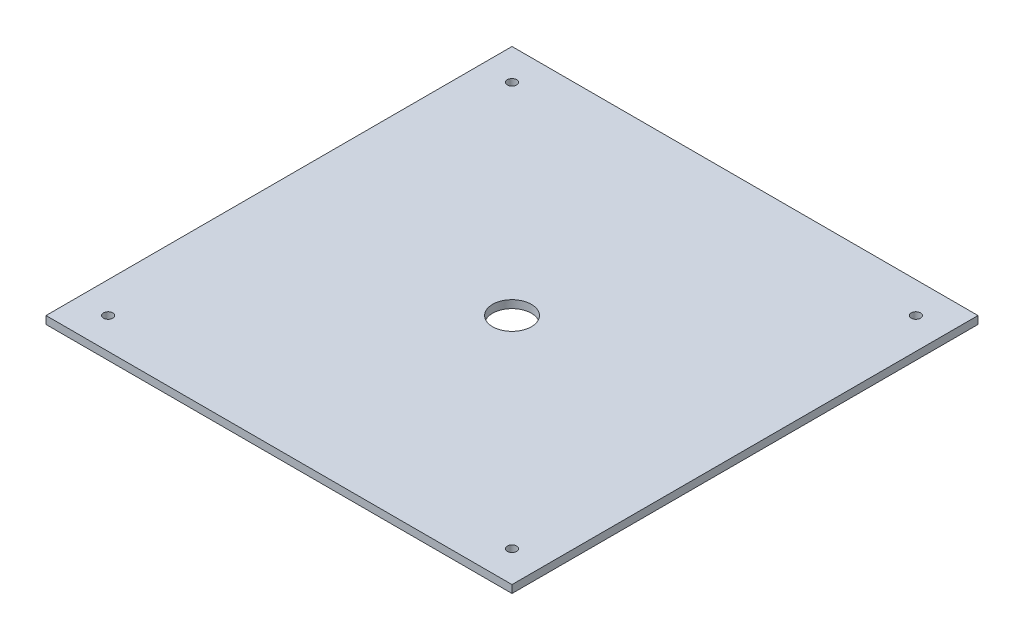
ISO-10303-21;
HEADER;
FILE_DESCRIPTION(('STEP AP214'),'2;1');
FILE_NAME('part.step','',(''),(''),'','','');
FILE_SCHEMA(('AUTOMOTIVE_DESIGN { 1 0 10303 214 1 1 1 1 }'));
ENDSEC;
DATA;
#1=APPLICATION_CONTEXT('core data for automotive mechanical design processes');
#2=APPLICATION_PROTOCOL_DEFINITION('international standard','automotive_design',2000,#1);
#3=PRODUCT_CONTEXT('',#1,'mechanical');
#4=PRODUCT('Part','Part','',(#3));
#5=PRODUCT_RELATED_PRODUCT_CATEGORY('part','',(#4));
#6=PRODUCT_DEFINITION_FORMATION('','',#4);
#7=PRODUCT_DEFINITION_CONTEXT('part definition',#1,'design');
#8=PRODUCT_DEFINITION('design','',#6,#7);
#9=PRODUCT_DEFINITION_SHAPE('','',#8);
#10=(LENGTH_UNIT() NAMED_UNIT(*) SI_UNIT(.MILLI.,.METRE.));
#11=(NAMED_UNIT(*) PLANE_ANGLE_UNIT() SI_UNIT($,.RADIAN.));
#12=(NAMED_UNIT(*) SI_UNIT($,.STERADIAN.) SOLID_ANGLE_UNIT());
#13=UNCERTAINTY_MEASURE_WITH_UNIT(LENGTH_MEASURE(1.E-05),#10,'distance_accuracy_value','');
#14=(GEOMETRIC_REPRESENTATION_CONTEXT(3) GLOBAL_UNCERTAINTY_ASSIGNED_CONTEXT((#13)) GLOBAL_UNIT_ASSIGNED_CONTEXT((#10,
#11,#12)) REPRESENTATION_CONTEXT('',''));
#15=CARTESIAN_POINT('',(0.,0.,0.));
#16=DIRECTION('',(0.,0.,1.));
#17=DIRECTION('',(1.,0.,0.));
#18=AXIS2_PLACEMENT_3D('',#15,#16,#17);
#19=CARTESIAN_POINT('',(0.,5.,0.));
#20=DIRECTION('',(1.,0.,0.));
#21=DIRECTION('',(0.,0.,-1.));
#22=AXIS2_PLACEMENT_3D('',#19,#20,#21);
#23=PLANE('',#22);
#24=DIRECTION('',(0.,0.,1.));
#25=VECTOR('',#24,1.);
#26=CARTESIAN_POINT('',(0.,0.,0.));
#27=LINE('',#26,#25);
#28=CARTESIAN_POINT('',(0.,0.,-300.));
#29=VERTEX_POINT('',#28);
#30=CARTESIAN_POINT('',(0.,0.,0.));
#31=VERTEX_POINT('',#30);
#32=EDGE_CURVE('E96',#29,#31,#27,.T.);
#33=ORIENTED_EDGE('',*,*,#32,.T.);
#34=DIRECTION('',(0.,-1.,0.));
#35=VECTOR('',#34,1.);
#36=CARTESIAN_POINT('',(0.,5.,0.));
#37=LINE('',#36,#35);
#38=CARTESIAN_POINT('',(0.,5.,0.));
#39=VERTEX_POINT('',#38);
#40=EDGE_CURVE('E11',#39,#31,#37,.T.);
#41=ORIENTED_EDGE('',*,*,#40,.F.);
#42=DIRECTION('',(0.,0.,1.));
#43=VECTOR('',#42,1.);
#44=CARTESIAN_POINT('',(0.,5.,0.));
#45=LINE('',#44,#43);
#46=CARTESIAN_POINT('',(0.,5.,-300.));
#47=VERTEX_POINT('',#46);
#48=EDGE_CURVE('E84',#47,#39,#45,.T.);
#49=ORIENTED_EDGE('',*,*,#48,.F.);
#50=DIRECTION('',(0.,-1.,0.));
#51=VECTOR('',#50,1.);
#52=CARTESIAN_POINT('',(0.,5.,-300.));
#53=LINE('',#52,#51);
#54=EDGE_CURVE('E92',#47,#29,#53,.T.);
#55=ORIENTED_EDGE('',*,*,#54,.T.);
#56=EDGE_LOOP('',(#33,#41,#49,#55));
#57=FACE_BOUND('',#56,.T.);
#58=ADVANCED_FACE('F33',(#57),#23,.F.);
#59=CARTESIAN_POINT('',(0.,5.,0.));
#60=DIRECTION('',(0.,0.,-1.));
#61=DIRECTION('',(-1.,0.,0.));
#62=AXIS2_PLACEMENT_3D('',#59,#60,#61);
#63=PLANE('',#62);
#64=DIRECTION('',(1.,0.,0.));
#65=VECTOR('',#64,1.);
#66=CARTESIAN_POINT('',(0.,0.,0.));
#67=LINE('',#66,#65);
#68=CARTESIAN_POINT('',(300.,0.,0.));
#69=VERTEX_POINT('',#68);
#70=EDGE_CURVE('E88',#31,#69,#67,.T.);
#71=ORIENTED_EDGE('',*,*,#70,.T.);
#72=DIRECTION('',(0.,-1.,0.));
#73=VECTOR('',#72,1.);
#74=CARTESIAN_POINT('',(300.,5.,0.));
#75=LINE('',#74,#73);
#76=CARTESIAN_POINT('',(300.,5.,0.));
#77=VERTEX_POINT('',#76);
#78=EDGE_CURVE('E41',#77,#69,#75,.T.);
#79=ORIENTED_EDGE('',*,*,#78,.F.);
#80=DIRECTION('',(1.,0.,0.));
#81=VECTOR('',#80,1.);
#82=CARTESIAN_POINT('',(0.,5.,0.));
#83=LINE('',#82,#81);
#84=EDGE_CURVE('E79',#39,#77,#83,.T.);
#85=ORIENTED_EDGE('',*,*,#84,.F.);
#86=ORIENTED_EDGE('',*,*,#40,.T.);
#87=EDGE_LOOP('',(#71,#79,#85,#86));
#88=FACE_BOUND('',#87,.T.);
#89=ADVANCED_FACE('F87',(#88),#63,.F.);
#90=CARTESIAN_POINT('',(300.,5.,0.));
#91=DIRECTION('',(-1.,0.,0.));
#92=DIRECTION('',(0.,0.,1.));
#93=AXIS2_PLACEMENT_3D('',#90,#91,#92);
#94=PLANE('',#93);
#95=DIRECTION('',(0.,0.,-1.));
#96=VECTOR('',#95,1.);
#97=CARTESIAN_POINT('',(300.,0.,0.));
#98=LINE('',#97,#96);
#99=CARTESIAN_POINT('',(300.,0.,-300.));
#100=VERTEX_POINT('',#99);
#101=EDGE_CURVE('E66',#69,#100,#98,.T.);
#102=ORIENTED_EDGE('',*,*,#101,.T.);
#103=DIRECTION('',(0.,-1.,0.));
#104=VECTOR('',#103,1.);
#105=CARTESIAN_POINT('',(300.,5.,-300.));
#106=LINE('',#105,#104);
#107=CARTESIAN_POINT('',(300.,5.,-300.));
#108=VERTEX_POINT('',#107);
#109=EDGE_CURVE('E89',#108,#100,#106,.T.);
#110=ORIENTED_EDGE('',*,*,#109,.F.);
#111=DIRECTION('',(0.,0.,-1.));
#112=VECTOR('',#111,1.);
#113=CARTESIAN_POINT('',(300.,5.,0.));
#114=LINE('',#113,#112);
#115=EDGE_CURVE('E82',#77,#108,#114,.T.);
#116=ORIENTED_EDGE('',*,*,#115,.F.);
#117=ORIENTED_EDGE('',*,*,#78,.T.);
#118=EDGE_LOOP('',(#102,#110,#116,#117));
#119=FACE_BOUND('',#118,.T.);
#120=ADVANCED_FACE('F90',(#119),#94,.F.);
#121=CARTESIAN_POINT('',(0.,5.,-300.));
#122=DIRECTION('',(0.,0.,1.));
#123=DIRECTION('',(1.,0.,0.));
#124=AXIS2_PLACEMENT_3D('',#121,#122,#123);
#125=PLANE('',#124);
#126=DIRECTION('',(-1.,0.,0.));
#127=VECTOR('',#126,1.);
#128=CARTESIAN_POINT('',(0.,0.,-300.));
#129=LINE('',#128,#127);
#130=EDGE_CURVE('E72',#100,#29,#129,.T.);
#131=ORIENTED_EDGE('',*,*,#130,.T.);
#132=ORIENTED_EDGE('',*,*,#54,.F.);
#133=DIRECTION('',(-1.,0.,0.));
#134=VECTOR('',#133,1.);
#135=CARTESIAN_POINT('',(0.,5.,-300.));
#136=LINE('',#135,#134);
#137=EDGE_CURVE('E49',#108,#47,#136,.T.);
#138=ORIENTED_EDGE('',*,*,#137,.F.);
#139=ORIENTED_EDGE('',*,*,#109,.T.);
#140=EDGE_LOOP('',(#131,#132,#138,#139));
#141=FACE_BOUND('',#140,.T.);
#142=ADVANCED_FACE('F104',(#141),#125,.F.);
#143=CARTESIAN_POINT('',(0.,5.,0.));
#144=DIRECTION('',(0.,-1.,0.));
#145=DIRECTION('',(0.,0.,-1.));
#146=AXIS2_PLACEMENT_3D('',#143,#144,#145);
#147=PLANE('',#146);
#148=CARTESIAN_POINT('',(150.,5.,-150.));
#149=DIRECTION('',(0.,1.,0.));
#150=DIRECTION('',(0.,0.,1.));
#151=AXIS2_PLACEMENT_3D('',#148,#149,#150);
#152=CIRCLE('',#151,12.5);
#153=CARTESIAN_POINT('',(150.,5.,-137.5));
#154=VERTEX_POINT('',#153);
#155=EDGE_CURVE('E136',#154,#154,#152,.T.);
#156=ORIENTED_EDGE('',*,*,#155,.F.);
#157=EDGE_LOOP('',(#156));
#158=FACE_BOUND('',#157,.T.);
#159=CARTESIAN_POINT('',(280.,5.,-280.));
#160=DIRECTION('',(0.,1.,0.));
#161=DIRECTION('',(0.,0.,-1.));
#162=AXIS2_PLACEMENT_3D('',#159,#160,#161);
#163=CIRCLE('',#162,2.99999999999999);
#164=CARTESIAN_POINT('',(280.,5.,-283.));
#165=VERTEX_POINT('',#164);
#166=EDGE_CURVE('E116',#165,#165,#163,.T.);
#167=ORIENTED_EDGE('',*,*,#166,.F.);
#168=EDGE_LOOP('',(#167));
#169=FACE_BOUND('',#168,.T.);
#170=CARTESIAN_POINT('',(280.,5.,-20.));
#171=DIRECTION('',(0.,1.,0.));
#172=DIRECTION('',(0.,0.,1.));
#173=AXIS2_PLACEMENT_3D('',#170,#171,#172);
#174=CIRCLE('',#173,2.99999999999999);
#175=CARTESIAN_POINT('',(280.,5.,-17.));
#176=VERTEX_POINT('',#175);
#177=EDGE_CURVE('E123',#176,#176,#174,.T.);
#178=ORIENTED_EDGE('',*,*,#177,.F.);
#179=EDGE_LOOP('',(#178));
#180=FACE_BOUND('',#179,.T.);
#181=CARTESIAN_POINT('',(20.,5.,-20.));
#182=DIRECTION('',(0.,1.,0.));
#183=DIRECTION('',(0.,0.,-1.));
#184=AXIS2_PLACEMENT_3D('',#181,#182,#183);
#185=CIRCLE('',#184,3.);
#186=CARTESIAN_POINT('',(20.,5.,-23.));
#187=VERTEX_POINT('',#186);
#188=EDGE_CURVE('E129',#187,#187,#185,.T.);
#189=ORIENTED_EDGE('',*,*,#188,.F.);
#190=EDGE_LOOP('',(#189));
#191=FACE_BOUND('',#190,.T.);
#192=CARTESIAN_POINT('',(20.,5.,-280.));
#193=DIRECTION('',(0.,1.,0.));
#194=DIRECTION('',(0.,0.,1.));
#195=AXIS2_PLACEMENT_3D('',#192,#193,#194);
#196=CIRCLE('',#195,3.);
#197=CARTESIAN_POINT('',(20.,5.,-277.));
#198=VERTEX_POINT('',#197);
#199=EDGE_CURVE('E110',#198,#198,#196,.T.);
#200=ORIENTED_EDGE('',*,*,#199,.F.);
#201=EDGE_LOOP('',(#200));
#202=FACE_BOUND('',#201,.T.);
#203=ORIENTED_EDGE('',*,*,#48,.T.);
#204=ORIENTED_EDGE('',*,*,#84,.T.);
#205=ORIENTED_EDGE('',*,*,#115,.T.);
#206=ORIENTED_EDGE('',*,*,#137,.T.);
#207=EDGE_LOOP('',(#203,#204,#205,#206));
#208=FACE_BOUND('',#207,.T.);
#209=ADVANCED_FACE('F80',(#158,#169,#180,#191,#202,#208),#147,.F.);
#210=CARTESIAN_POINT('',(0.,0.,0.));
#211=DIRECTION('',(0.,-1.,0.));
#212=DIRECTION('',(0.,0.,-1.));
#213=AXIS2_PLACEMENT_3D('',#210,#211,#212);
#214=PLANE('',#213);
#215=CARTESIAN_POINT('',(150.,0.,-150.));
#216=DIRECTION('',(0.,-1.,0.));
#217=DIRECTION('',(0.,0.,-1.));
#218=AXIS2_PLACEMENT_3D('',#215,#216,#217);
#219=CIRCLE('',#218,12.5);
#220=CARTESIAN_POINT('',(150.,0.,-162.5));
#221=VERTEX_POINT('',#220);
#222=EDGE_CURVE('E120',#221,#221,#219,.F.);
#223=ORIENTED_EDGE('',*,*,#222,.T.);
#224=EDGE_LOOP('',(#223));
#225=FACE_BOUND('',#224,.T.);
#226=CARTESIAN_POINT('',(280.,0.,-280.));
#227=DIRECTION('',(0.,1.,0.));
#228=DIRECTION('',(0.,0.,-1.));
#229=AXIS2_PLACEMENT_3D('',#226,#227,#228);
#230=CIRCLE('',#229,2.99999999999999);
#231=CARTESIAN_POINT('',(280.,0.,-283.));
#232=VERTEX_POINT('',#231);
#233=EDGE_CURVE('E119',#232,#232,#230,.T.);
#234=ORIENTED_EDGE('',*,*,#233,.T.);
#235=EDGE_LOOP('',(#234));
#236=FACE_BOUND('',#235,.T.);
#237=CARTESIAN_POINT('',(280.,0.,-20.));
#238=DIRECTION('',(0.,1.,0.));
#239=DIRECTION('',(0.,0.,1.));
#240=AXIS2_PLACEMENT_3D('',#237,#238,#239);
#241=CIRCLE('',#240,2.99999999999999);
#242=CARTESIAN_POINT('',(280.,0.,-17.));
#243=VERTEX_POINT('',#242);
#244=EDGE_CURVE('E126',#243,#243,#241,.T.);
#245=ORIENTED_EDGE('',*,*,#244,.T.);
#246=EDGE_LOOP('',(#245));
#247=FACE_BOUND('',#246,.T.);
#248=CARTESIAN_POINT('',(20.,0.,-20.));
#249=DIRECTION('',(0.,1.,0.));
#250=DIRECTION('',(0.,0.,-1.));
#251=AXIS2_PLACEMENT_3D('',#248,#249,#250);
#252=CIRCLE('',#251,3.);
#253=CARTESIAN_POINT('',(20.,0.,-23.));
#254=VERTEX_POINT('',#253);
#255=EDGE_CURVE('E113',#254,#254,#252,.T.);
#256=ORIENTED_EDGE('',*,*,#255,.T.);
#257=EDGE_LOOP('',(#256));
#258=FACE_BOUND('',#257,.T.);
#259=CARTESIAN_POINT('',(20.,0.,-280.));
#260=DIRECTION('',(0.,1.,0.));
#261=DIRECTION('',(0.,0.,1.));
#262=AXIS2_PLACEMENT_3D('',#259,#260,#261);
#263=CIRCLE('',#262,3.);
#264=CARTESIAN_POINT('',(20.,0.,-277.));
#265=VERTEX_POINT('',#264);
#266=EDGE_CURVE('E99',#265,#265,#263,.T.);
#267=ORIENTED_EDGE('',*,*,#266,.T.);
#268=EDGE_LOOP('',(#267));
#269=FACE_BOUND('',#268,.T.);
#270=ORIENTED_EDGE('',*,*,#32,.F.);
#271=ORIENTED_EDGE('',*,*,#130,.F.);
#272=ORIENTED_EDGE('',*,*,#101,.F.);
#273=ORIENTED_EDGE('',*,*,#70,.F.);
#274=EDGE_LOOP('',(#270,#271,#272,#273));
#275=FACE_BOUND('',#274,.T.);
#276=ADVANCED_FACE('F107',(#225,#236,#247,#258,#269,#275),#214,.T.);
#277=CARTESIAN_POINT('',(20.,0.,-280.));
#278=DIRECTION('',(0.,1.,0.));
#279=DIRECTION('',(0.,0.,1.));
#280=AXIS2_PLACEMENT_3D('',#277,#278,#279);
#281=CYLINDRICAL_SURFACE('',#280,3.);
#282=ORIENTED_EDGE('',*,*,#266,.F.);
#283=EDGE_LOOP('',(#282));
#284=FACE_BOUND('',#283,.T.);
#285=ORIENTED_EDGE('',*,*,#199,.T.);
#286=EDGE_LOOP('',(#285));
#287=FACE_BOUND('',#286,.T.);
#288=ADVANCED_FACE('F154',(#284,#287),#281,.F.);
#289=CARTESIAN_POINT('',(20.,0.,-20.));
#290=DIRECTION('',(0.,1.,0.));
#291=DIRECTION('',(0.,0.,1.));
#292=AXIS2_PLACEMENT_3D('',#289,#290,#291);
#293=CYLINDRICAL_SURFACE('',#292,3.);
#294=ORIENTED_EDGE('',*,*,#255,.F.);
#295=EDGE_LOOP('',(#294));
#296=FACE_BOUND('',#295,.T.);
#297=ORIENTED_EDGE('',*,*,#188,.T.);
#298=EDGE_LOOP('',(#297));
#299=FACE_BOUND('',#298,.T.);
#300=ADVANCED_FACE('F156',(#296,#299),#293,.F.);
#301=CARTESIAN_POINT('',(280.,0.,-20.));
#302=DIRECTION('',(0.,1.,0.));
#303=DIRECTION('',(0.,0.,1.));
#304=AXIS2_PLACEMENT_3D('',#301,#302,#303);
#305=CYLINDRICAL_SURFACE('',#304,2.99999999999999);
#306=ORIENTED_EDGE('',*,*,#244,.F.);
#307=EDGE_LOOP('',(#306));
#308=FACE_BOUND('',#307,.T.);
#309=ORIENTED_EDGE('',*,*,#177,.T.);
#310=EDGE_LOOP('',(#309));
#311=FACE_BOUND('',#310,.T.);
#312=ADVANCED_FACE('F163',(#308,#311),#305,.F.);
#313=CARTESIAN_POINT('',(280.,0.,-280.));
#314=DIRECTION('',(0.,1.,0.));
#315=DIRECTION('',(0.,0.,1.));
#316=AXIS2_PLACEMENT_3D('',#313,#314,#315);
#317=CYLINDRICAL_SURFACE('',#316,2.99999999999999);
#318=ORIENTED_EDGE('',*,*,#233,.F.);
#319=EDGE_LOOP('',(#318));
#320=FACE_BOUND('',#319,.T.);
#321=ORIENTED_EDGE('',*,*,#166,.T.);
#322=EDGE_LOOP('',(#321));
#323=FACE_BOUND('',#322,.T.);
#324=ADVANCED_FACE('F202',(#320,#323),#317,.F.);
#325=CARTESIAN_POINT('',(150.,-35.3553390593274,-150.));
#326=DIRECTION('',(0.,1.,0.));
#327=DIRECTION('',(0.,0.,1.));
#328=AXIS2_PLACEMENT_3D('',#325,#326,#327);
#329=CYLINDRICAL_SURFACE('',#328,12.5);
#330=ORIENTED_EDGE('',*,*,#155,.T.);
#331=EDGE_LOOP('',(#330));
#332=FACE_BOUND('',#331,.T.);
#333=ORIENTED_EDGE('',*,*,#222,.F.);
#334=EDGE_LOOP('',(#333));
#335=FACE_BOUND('',#334,.T.);
#336=ADVANCED_FACE('F140',(#332,#335),#329,.F.);
#337=CLOSED_SHELL('',(#58,#89,#120,#142,#209,#276,#288,#300,#312,#324,#336));
#338=MANIFOLD_SOLID_BREP('B2',#337);
#339=ADVANCED_BREP_SHAPE_REPRESENTATION('',(#18,#338),#14);
#340=SHAPE_DEFINITION_REPRESENTATION(#9,#339);
ENDSEC;
END-ISO-10303-21;
